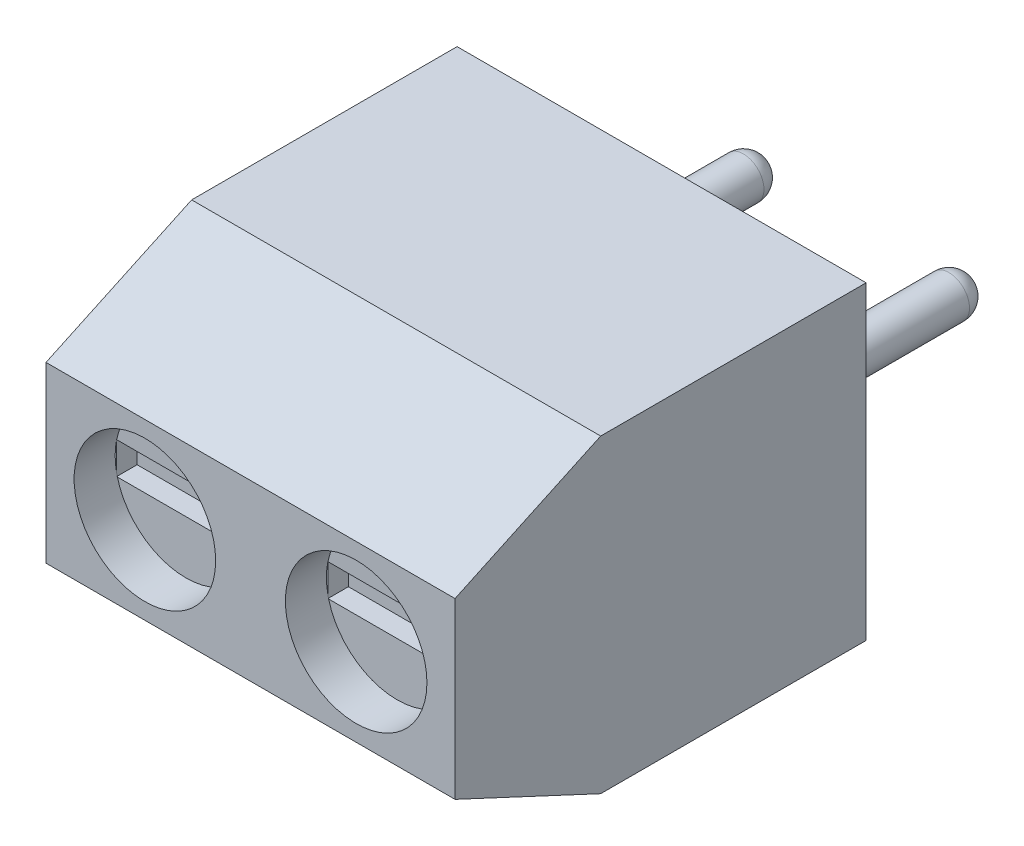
from build123d import *
from OCP.BRepFilletAPI import BRepFilletAPI_MakeChamfer

# Parameters (mm, degrees)
ESQUISSE1_W             = 9.97
ESQUISSE1_H             = 7.55
EXTRUSION1_DEPTH        = 10.02
CHANFREIN1_SIZE         = 3.55
CHANFREIN1_SIZE2        = 1.655392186
ESQUISSE2_R             = 1.725
ENL_V_MAT_EXTRU_1_DEPTH = 1
ESQUISSE3_W             = 4
ESQUISSE3_H             = 5
ENL_V_MAT_EXTRU_2_DEPTH = 1.6
ESQUISSE4_R             = 1.675
ENL_V_MAT_EXTRU_3_DEPTH = 1.6
ESQUISSE5_R             = 0.5
EXTRUSION2_DEPTH        = 5
CONG_1_R                = 0.5
ESQUISSE7_W             = 3.359641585
ESQUISSE7_H             = 0.780050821
ENL_V_MAT_EXTRU_4_DEPTH = 0.5
ESQUISSE8_W             = 3.1960084
ESQUISSE8_H             = 1.003036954
ENL_V_MAT_EXTRU_5_DEPTH = 0.5


with BuildPart() as part:
    # Esquisse1 → Extrusion1 (new body)
    with BuildSketch(Plane.XY):
        with Locations((4.985, 3.775)):
            Rectangle(ESQUISSE1_W, ESQUISSE1_H)
    extrude(amount=EXTRUSION1_DEPTH)

    # Chanfrein1: one chamfer whose edges measure the first distance from different faces: ONE call of the kernel's chamfer builder (chamfer() names one face for all edges)
    chanfrein1_edges_1 = [part.edges().sort_by_distance(p)[0] for p in [
        (4.985, 7.55, 10.02),
    ]]
    chanfrein1_side_1 = [part.faces().sort_by_distance(p)[0] for p in [
        (4.985, 7.55, 5.01),
    ]]
    chanfrein1_edges_2 = [part.edges().sort_by_distance(p)[0] for p in [
        (4.985, 0, 10.02),
    ]]
    chanfrein1_side_2 = [part.faces().sort_by_distance(p)[0] for p in [
        (4.985, 0, 5.01),
    ]]
    chanfrein1 = BRepFilletAPI_MakeChamfer(part.part.solid().wrapped)
    for e in chanfrein1_edges_1:
        chanfrein1.Add(CHANFREIN1_SIZE, CHANFREIN1_SIZE2, e.wrapped, chanfrein1_side_1[0].wrapped)  # the first distance lies on this face
    for e in chanfrein1_edges_2:
        chanfrein1.Add(CHANFREIN1_SIZE, CHANFREIN1_SIZE2, e.wrapped, chanfrein1_side_2[0].wrapped)  # the first distance lies on this face
    add(Compound.cast(chanfrein1.Shape()), mode=Mode.REPLACE)

    # Esquisse2 → Enl_v. mat.-Extru.1 (cut)
    with BuildSketch(Plane.XY.offset(10.02)):
        with Locations((2.410120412, 3.775)):
            Circle(ESQUISSE2_R)
        with Locations((7.559879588, 3.775)):
            Circle(ESQUISSE2_R)
    extrude(amount=-ENL_V_MAT_EXTRU_1_DEPTH, mode=Mode.SUBTRACT)

    # Esquisse3 → Enl_v. mat.-Extru.2 (cut)
    with BuildSketch(Plane.XZ):
        with Locations((7.435, 3.3)):
            Rectangle(ESQUISSE3_W, ESQUISSE3_H)
        with Locations((2.535, 3.3)):
            Rectangle(ESQUISSE3_W, ESQUISSE3_H)
    extrude(amount=-ENL_V_MAT_EXTRU_2_DEPTH, mode=Mode.SUBTRACT)

    # Esquisse4 → Enl_v. mat.-Extru.3 (cut)
    with BuildSketch(Plane.XZ.offset(-1.6)):
        with Locations(Location((7.435, 3.235, 0), (0, 0, 270))):
            Circle(ESQUISSE4_R)
        with Locations(Location((2.535, 3.235, 0), (0, 0, 270))):
            Circle(ESQUISSE4_R)
    extrude(amount=-ENL_V_MAT_EXTRU_3_DEPTH, mode=Mode.SUBTRACT)

    # Esquisse5 → Extrusion2 (add)
    with BuildSketch(Plane(origin=(0, 0, 0), x_dir=(-1, 0, 0), z_dir=(0, 0, -1))):
        with Locations((-7.49, 3.775)):
            Circle(ESQUISSE5_R)
        with Locations((-2.48, 3.775)):
            Circle(ESQUISSE5_R)
    extrude(amount=EXTRUSION2_DEPTH)

    # Cong_1
    cong_1_edges = [part.edges().sort_by_distance(p)[0] for p in [
        (7.99, 3.775, -5),
        (2.98, 3.775, -5),
    ]]
    fillet(cong_1_edges, radius=CONG_1_R)

    # Esquisse7 → Enl_v. mat.-Extru.4 (cut)
    with BuildSketch(Plane.XY.offset(9.02)):
        with Locations((2.40077537, 3.734751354)):
            Rectangle(ESQUISSE7_W, ESQUISSE7_H)
        with Locations((7.550534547, 3.734751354)):
            Rectangle(ESQUISSE7_W, ESQUISSE7_H)
    extrude(amount=-ENL_V_MAT_EXTRU_4_DEPTH, mode=Mode.SUBTRACT)

    # Esquisse8 → Enl_v. mat.-Extru.5 (cut)
    with BuildSketch(Plane.XZ.offset(-3.2)):
        with Locations((2.54160667, 3.256051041)):
            Rectangle(ESQUISSE8_W, ESQUISSE8_H)
        with Locations((7.44160667, 3.256051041)):
            Rectangle(ESQUISSE8_W, ESQUISSE8_H)
    extrude(amount=-ENL_V_MAT_EXTRU_5_DEPTH, mode=Mode.SUBTRACT)


solid = part.part
